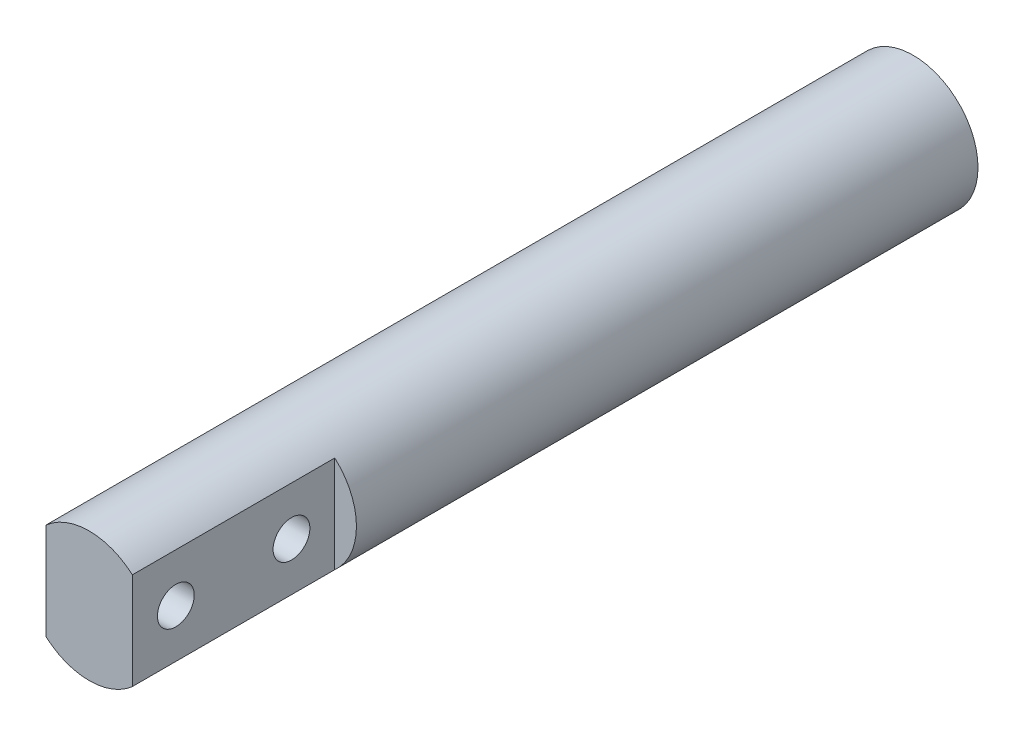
from build123d import *

# Parameters (mm, degrees)
SKETCH1_R              = 7.11835
EXTRUDE1_DEPTH         = 90.4748
SKETCH2_W              = 3.32691843
SKETCH2_H              = 13.040892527
SKETCH2_W_2            = 4.645131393
SKETCH2_H_2            = 13.260594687
CUT_EXTRUDE1_DEPTH     = 22.225
F_10_32_TAPPED_HOLE1_D = 4.0386


with BuildPart() as part:
    # Sketch1 → Extrude1 (new body)
    with BuildSketch(Plane.XY):
        Circle(SKETCH1_R)
    extrude(amount=-EXTRUDE1_DEPTH)

    # Sketch2 → Cut-Extrude1 (cut)
    with BuildSketch(Plane.XY):
        with Locations((-6.406909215, 0.133390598)):
            Rectangle(SKETCH2_W, SKETCH2_H)
        with Locations((7.059665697, 0.243241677)):
            Rectangle(SKETCH2_W_2, SKETCH2_H_2)
    extrude(amount=-CUT_EXTRUDE1_DEPTH, mode=Mode.SUBTRACT)

    # 10-32 Tapped Hole1 (through all)
    with Locations(Plane.ZY.offset(4.74345)):
        with Locations((-17.4752, 0), (-4.7752, 0)):
            Hole(F_10_32_TAPPED_HOLE1_D / 2)


solid = part.part
